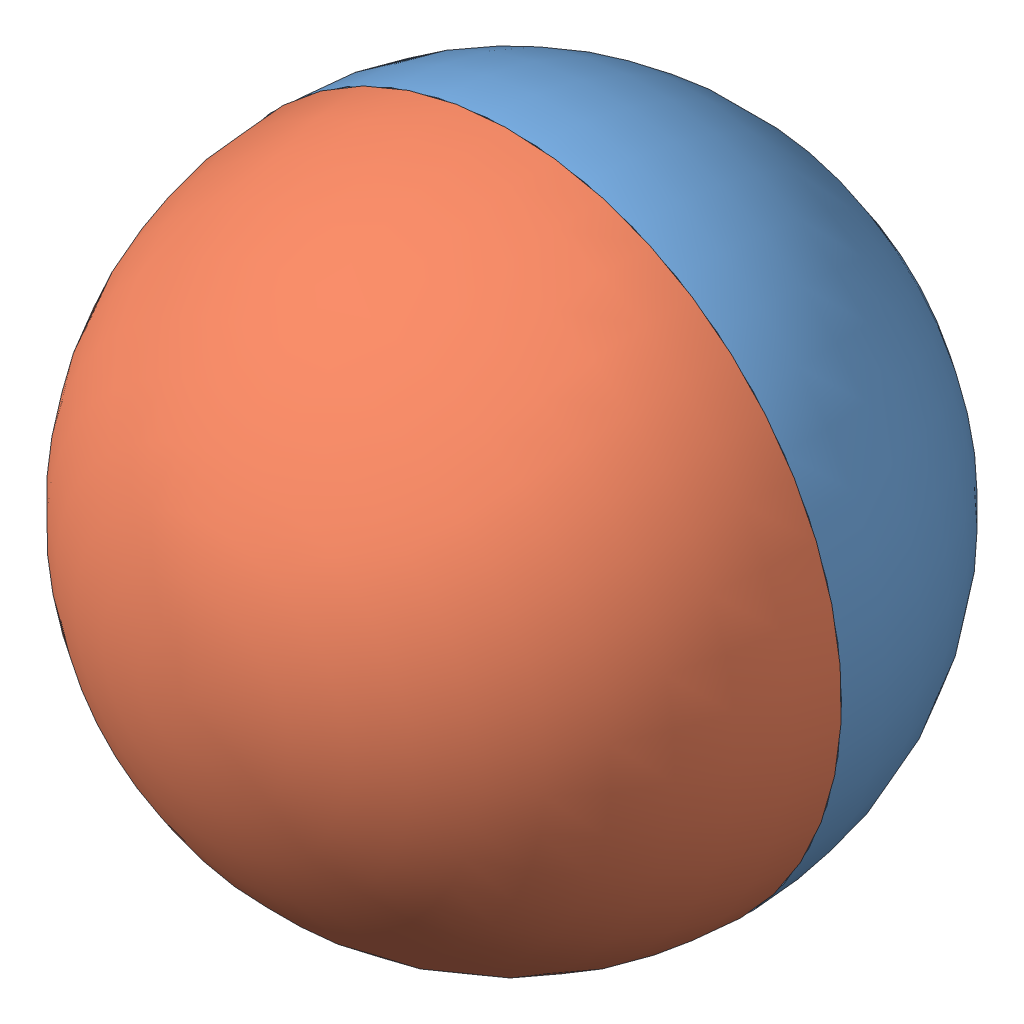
SolidWorks assembly Assemblage2.sldasm, configuration Défaut (file format 3100). Lengths in mm.
Overall size (26.14 26.14 20).
2 component instances, 2 part files, 2 mates.
Components (placement in the parent):
- Demi-bille M-1: Demi-bille M.SLDPRT [Défaut] at origin size (20 20 11)
- Demi-bille F-2: Demi-bille F.SLDPRT [Défaut] x (-0.923728 -0.383049 0) z (0 0 -1) size (20 20 10)
Mates (geometry in assembly coordinates):
- Coïncidente1: coincident: 
- Coaxiale1: concentric: 
